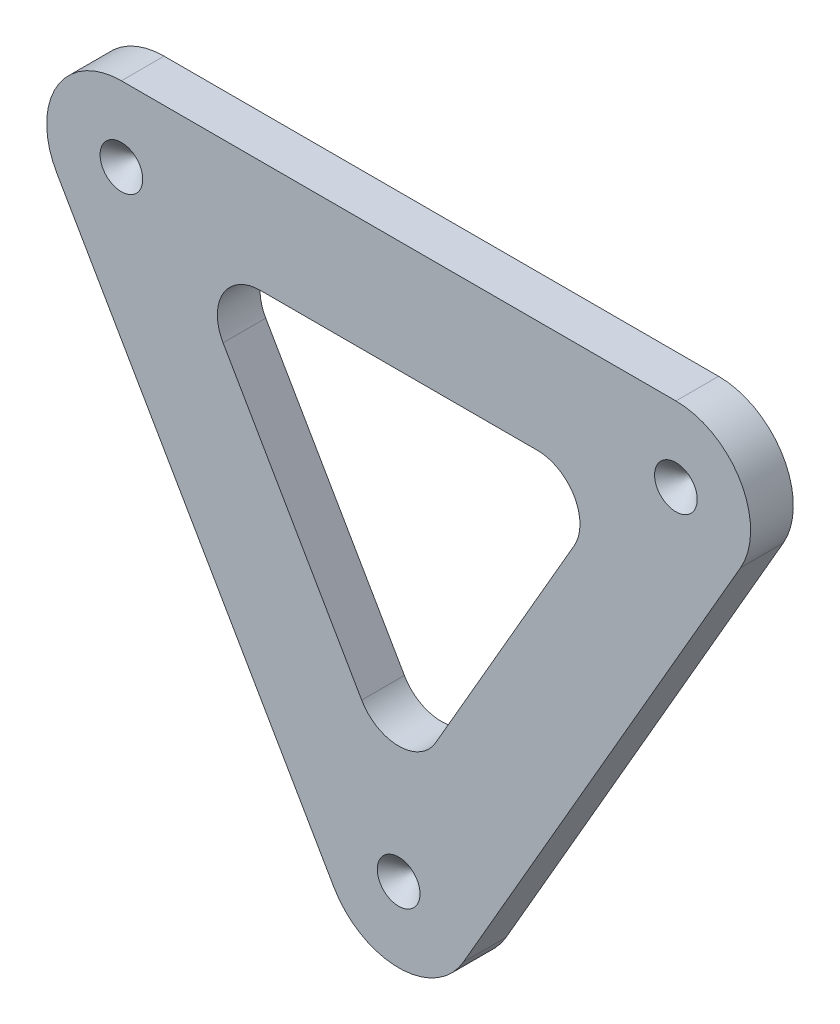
from build123d import *

# Parameters (mm, degrees)
AUFSATZ_LINEAR_AUSTRAGEN1_DEPTH = 2
VERRUNDUNG1_R                   = 2


with BuildPart() as part:
    # Skizze1 → Aufsatz-Linear austragen1 (new body)
    with BuildSketch(Plane.XY):
        with BuildLine():
            Line((3.031088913, -16.75), (16.02146997, 5.75))
            ThreePointArc((16.02146997, 5.75), (16.02146997, 9.25), (12.990381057, 11))
            Line((12.990381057, 11), (-12.990381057, 11))
            ThreePointArc((-12.990381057, 11), (-16.02146997, 9.25), (-16.02146997, 5.75))
            Line((-16.02146997, 5.75), (-3.031088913, -16.75))
            ThreePointArc((-3.031088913, -16.75), (0, -18.5), (3.031088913, -16.75))
        make_face()
        Polygon((9.959292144, 5.75), (-9.959292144, 5.75), (0, -11.5), align=None, mode=Mode.SUBTRACT)
    extrude(amount=AUFSATZ_LINEAR_AUSTRAGEN1_DEPTH)

    # Verrundung1
    verrundung1_edges = [part.edges().sort_by_distance(p)[0] for p in [
        (0, -11.5, 1),
        (9.959292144, 5.75, 1),
        (-9.959292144, 5.75, 1),
    ]]
    fillet(verrundung1_edges, radius=VERRUNDUNG1_R)

    # Schnitt-Linear austragen1 cone 1 section (on through the dimple's axis) → Schnitt-Linear austragen1 (revolve, cut)
    with BuildSketch(Plane(origin=(12.990381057, 7.5, 2), x_dir=(0, -1, 0), z_dir=(1, 0, 0))):
        Polygon((0, 0), (1, 0), (0, 1), align=None)
    revolve(axis=Axis((12.990381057, 7.5, 2), (0, 0, -1)), mode=Mode.SUBTRACT)

    # Schnitt-Linear austragen1 cone 2 section (on through the dimple's axis) → Schnitt-Linear austragen1 cone 2 (revolve, cut)
    with BuildSketch(Plane(origin=(0, -15, 2), x_dir=(0, -1, 0), z_dir=(1, 0, 0))):
        Polygon((0, 0), (1, 0), (0, 1), align=None)
    revolve(axis=Axis((0, -15, 2), (0, 0, -1)), mode=Mode.SUBTRACT)

    # Schnitt-Linear austragen1 cone 3 section (on through the dimple's axis) → Schnitt-Linear austragen1 cone 3 (revolve, cut)
    with BuildSketch(Plane(origin=(-12.990381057, 7.5, 2), x_dir=(0, -1, 0), z_dir=(1, 0, 0))):
        Polygon((0, 0), (1, 0), (0, 1), align=None)
    revolve(axis=Axis((-12.990381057, 7.5, 2), (0, 0, -1)), mode=Mode.SUBTRACT)


solid = part.part
